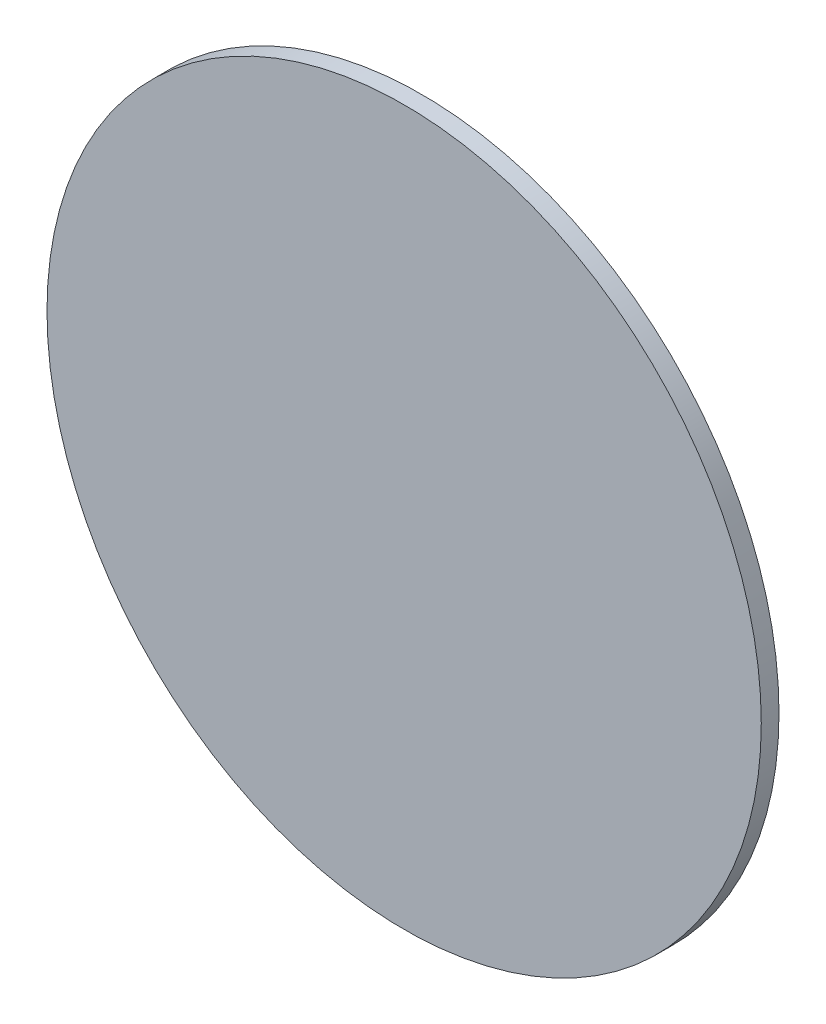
ISO-10303-21;
HEADER;
FILE_DESCRIPTION(('STEP AP214'),'2;1');
FILE_NAME('part.step','',(''),(''),'','','');
FILE_SCHEMA(('AUTOMOTIVE_DESIGN { 1 0 10303 214 1 1 1 1 }'));
ENDSEC;
DATA;
#1=APPLICATION_CONTEXT('core data for automotive mechanical design processes');
#2=APPLICATION_PROTOCOL_DEFINITION('international standard','automotive_design',2000,#1);
#3=PRODUCT_CONTEXT('',#1,'mechanical');
#4=PRODUCT('Part','Part','',(#3));
#5=PRODUCT_RELATED_PRODUCT_CATEGORY('part','',(#4));
#6=PRODUCT_DEFINITION_FORMATION('','',#4);
#7=PRODUCT_DEFINITION_CONTEXT('part definition',#1,'design');
#8=PRODUCT_DEFINITION('design','',#6,#7);
#9=PRODUCT_DEFINITION_SHAPE('','',#8);
#10=(LENGTH_UNIT() NAMED_UNIT(*) SI_UNIT(.MILLI.,.METRE.));
#11=(NAMED_UNIT(*) PLANE_ANGLE_UNIT() SI_UNIT($,.RADIAN.));
#12=(NAMED_UNIT(*) SI_UNIT($,.STERADIAN.) SOLID_ANGLE_UNIT());
#13=UNCERTAINTY_MEASURE_WITH_UNIT(LENGTH_MEASURE(1.E-05),#10,'distance_accuracy_value','');
#14=(GEOMETRIC_REPRESENTATION_CONTEXT(3) GLOBAL_UNCERTAINTY_ASSIGNED_CONTEXT((#13)) GLOBAL_UNIT_ASSIGNED_CONTEXT((#10,
#11,#12)) REPRESENTATION_CONTEXT('',''));
#15=CARTESIAN_POINT('',(0.,0.,0.));
#16=DIRECTION('',(0.,0.,1.));
#17=DIRECTION('',(1.,0.,0.));
#18=AXIS2_PLACEMENT_3D('',#15,#16,#17);
#19=CARTESIAN_POINT('',(0.,-18.9357,6.5786));
#20=DIRECTION('',(0.,0.,1.));
#21=DIRECTION('',(1.,0.,0.));
#22=AXIS2_PLACEMENT_3D('',#19,#20,#21);
#23=PLANE('',#22);
#24=CARTESIAN_POINT('',(0.,0.,6.5786));
#25=DIRECTION('',(0.,0.,1.));
#26=DIRECTION('',(1.,0.,0.));
#27=AXIS2_PLACEMENT_3D('',#24,#25,#26);
#28=CIRCLE('',#27,18.9357);
#29=CARTESIAN_POINT('',(18.9357,0.,6.5786));
#30=VERTEX_POINT('',#29);
#31=EDGE_CURVE('E18',#30,#30,#28,.T.);
#32=ORIENTED_EDGE('',*,*,#31,.F.);
#33=EDGE_LOOP('',(#32));
#34=FACE_BOUND('',#33,.T.);
#35=ADVANCED_FACE('F15',(#34),#23,.F.);
#36=CARTESIAN_POINT('',(0.,0.,-57.));
#37=DIRECTION('',(0.,0.,1.));
#38=DIRECTION('',(1.,0.,0.));
#39=AXIS2_PLACEMENT_3D('',#36,#37,#38);
#40=CYLINDRICAL_SURFACE('',#39,18.9357);
#41=ORIENTED_EDGE('',*,*,#31,.T.);
#42=EDGE_LOOP('',(#41));
#43=FACE_BOUND('',#42,.T.);
#44=CARTESIAN_POINT('',(0.,0.,7.51840000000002));
#45=DIRECTION('',(0.,0.,1.));
#46=DIRECTION('',(1.,0.,0.));
#47=AXIS2_PLACEMENT_3D('',#44,#45,#46);
#48=CIRCLE('',#47,18.9357);
#49=CARTESIAN_POINT('',(18.9357,0.,7.51840000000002));
#50=VERTEX_POINT('',#49);
#51=EDGE_CURVE('E10',#50,#50,#48,.F.);
#52=ORIENTED_EDGE('',*,*,#51,.T.);
#53=EDGE_LOOP('',(#52));
#54=FACE_BOUND('',#53,.T.);
#55=ADVANCED_FACE('F27',(#43,#54),#40,.T.);
#56=CARTESIAN_POINT('',(0.,0.,7.51840000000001));
#57=DIRECTION('',(0.,0.,-1.));
#58=DIRECTION('',(-1.,0.,0.));
#59=AXIS2_PLACEMENT_3D('',#56,#57,#58);
#60=PLANE('',#59);
#61=ORIENTED_EDGE('',*,*,#51,.F.);
#62=EDGE_LOOP('',(#61));
#63=FACE_BOUND('',#62,.T.);
#64=ADVANCED_FACE('F34',(#63),#60,.F.);
#65=CLOSED_SHELL('',(#35,#55,#64));
#66=MANIFOLD_SOLID_BREP('B1',#65);
#67=ADVANCED_BREP_SHAPE_REPRESENTATION('',(#18,#66),#14);
#68=SHAPE_DEFINITION_REPRESENTATION(#9,#67);
ENDSEC;
END-ISO-10303-21;
